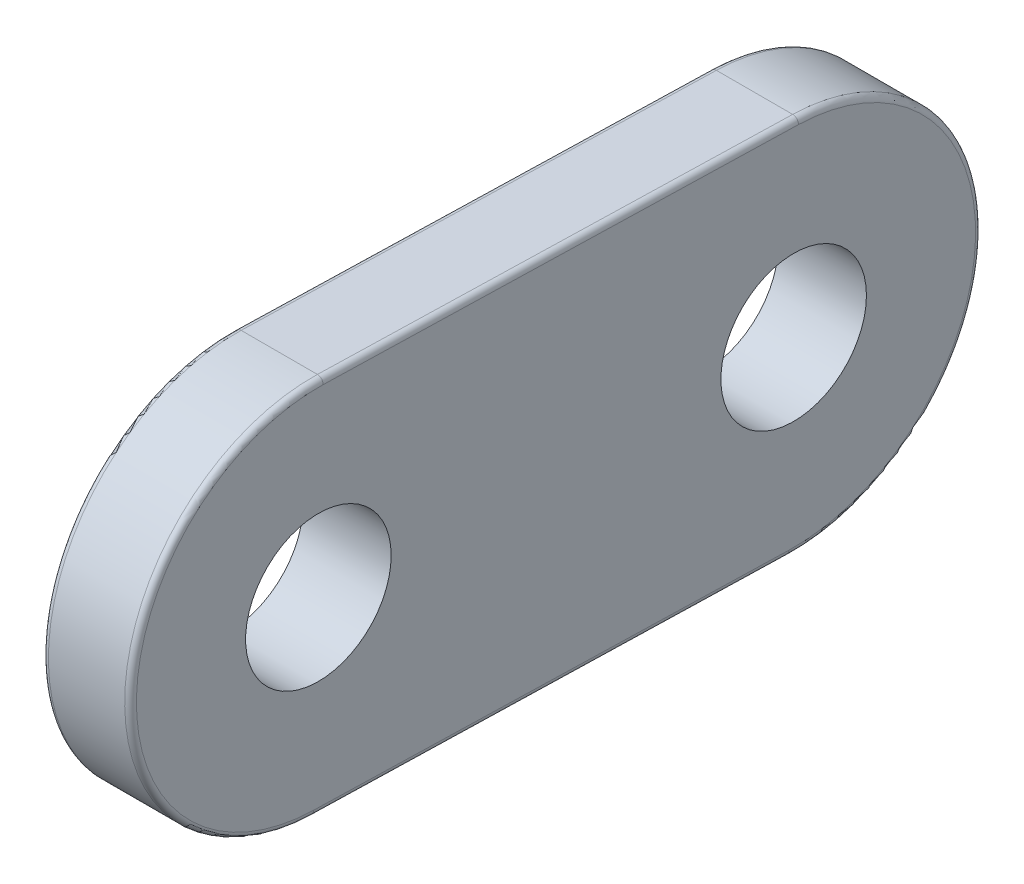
ISO-10303-21;
HEADER;
FILE_DESCRIPTION(('STEP AP214'),'2;1');
FILE_NAME('part.step','',(''),(''),'','','');
FILE_SCHEMA(('AUTOMOTIVE_DESIGN { 1 0 10303 214 1 1 1 1 }'));
ENDSEC;
DATA;
#1=APPLICATION_CONTEXT('core data for automotive mechanical design processes');
#2=APPLICATION_PROTOCOL_DEFINITION('international standard','automotive_design',2000,#1);
#3=PRODUCT_CONTEXT('',#1,'mechanical');
#4=PRODUCT('Part','Part','',(#3));
#5=PRODUCT_RELATED_PRODUCT_CATEGORY('part','',(#4));
#6=PRODUCT_DEFINITION_FORMATION('','',#4);
#7=PRODUCT_DEFINITION_CONTEXT('part definition',#1,'design');
#8=PRODUCT_DEFINITION('design','',#6,#7);
#9=PRODUCT_DEFINITION_SHAPE('','',#8);
#10=(LENGTH_UNIT() NAMED_UNIT(*) SI_UNIT(.MILLI.,.METRE.));
#11=(NAMED_UNIT(*) PLANE_ANGLE_UNIT() SI_UNIT($,.RADIAN.));
#12=(NAMED_UNIT(*) SI_UNIT($,.STERADIAN.) SOLID_ANGLE_UNIT());
#13=UNCERTAINTY_MEASURE_WITH_UNIT(LENGTH_MEASURE(1.E-05),#10,'distance_accuracy_value','');
#14=(GEOMETRIC_REPRESENTATION_CONTEXT(3) GLOBAL_UNCERTAINTY_ASSIGNED_CONTEXT((#13)) GLOBAL_UNIT_ASSIGNED_CONTEXT((#10,
#11,#12)) REPRESENTATION_CONTEXT('',''));
#15=CARTESIAN_POINT('',(0.,0.,0.));
#16=DIRECTION('',(0.,0.,1.));
#17=DIRECTION('',(1.,0.,0.));
#18=AXIS2_PLACEMENT_3D('',#15,#16,#17);
#19=CARTESIAN_POINT('',(-2.032,4.5213108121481,0.0559648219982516));
#20=DIRECTION('',(0.,-0.026176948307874,-0.999657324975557));
#21=DIRECTION('',(0.,0.999657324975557,-0.026176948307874));
#22=AXIS2_PLACEMENT_3D('',#19,#20,#21);
#23=CYLINDRICAL_SURFACE('',#22,0.127);
#24=CARTESIAN_POINT('',(-2.032,4.31934911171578,-7.65664135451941));
#25=DIRECTION('',(0.,-0.0261769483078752,-0.999657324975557));
#26=DIRECTION('',(0.,0.999657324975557,-0.0261769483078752));
#27=AXIS2_PLACEMENT_3D('',#24,#25,#26);
#28=CIRCLE('',#27,0.126999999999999);
#29=CARTESIAN_POINT('',(-1.905,4.31934911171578,-7.65664135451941));
#30=VERTEX_POINT('',#29);
#31=CARTESIAN_POINT('',(-2.032,4.19239263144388,-7.65331688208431));
#32=VERTEX_POINT('',#31);
#33=EDGE_CURVE('E69',#30,#32,#28,.T.);
#34=ORIENTED_EDGE('',*,*,#33,.F.);
#35=DIRECTION('',(0.,-0.0261769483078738,-0.999657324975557));
#36=VECTOR('',#35,1.);
#37=CARTESIAN_POINT('',(-1.905,4.58863137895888,2.62683354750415));
#38=LINE('',#37,#36);
#39=CARTESIAN_POINT('',(-1.905,4.58863137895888,2.62683354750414));
#40=VERTEX_POINT('',#39);
#41=EDGE_CURVE('E75',#40,#30,#38,.T.);
#42=ORIENTED_EDGE('',*,*,#41,.F.);
#43=CARTESIAN_POINT('',(-2.032,4.58863137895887,2.62683354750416));
#44=DIRECTION('',(0.,0.0261769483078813,0.999657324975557));
#45=DIRECTION('',(0.,-0.999657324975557,0.0261769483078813));
#46=AXIS2_PLACEMENT_3D('',#43,#44,#45);
#47=CIRCLE('',#46,0.127);
#48=CARTESIAN_POINT('',(-2.032,4.46167489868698,2.63015801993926));
#49=VERTEX_POINT('',#48);
#50=EDGE_CURVE('E136',#49,#40,#47,.T.);
#51=ORIENTED_EDGE('',*,*,#50,.F.);
#52=DIRECTION('',(0.,0.026176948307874,0.999657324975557));
#53=VECTOR('',#52,1.);
#54=CARTESIAN_POINT('',(-2.032,4.32703376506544,-2.51157943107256));
#55=LINE('',#54,#53);
#56=EDGE_CURVE('E81',#49,#32,#55,.F.);
#57=ORIENTED_EDGE('',*,*,#56,.T.);
#58=EDGE_LOOP('',(#34,#42,#51,#57));
#59=FACE_BOUND('',#58,.T.);
#60=ADVANCED_FACE('F17',(#59),#23,.T.);
#61=CARTESIAN_POINT('',(-2.032,8.25500000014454,-7.75970000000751));
#62=DIRECTION('',(1.,0.,0.));
#63=DIRECTION('',(0.,1.,0.));
#64=AXIS2_PLACEMENT_3D('',#61,#62,#63);
#65=TOROIDAL_SURFACE('',#64,3.937,0.127);
#66=CARTESIAN_POINT('',(-2.032,8.25500000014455,-7.75970000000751));
#67=DIRECTION('',(1.,0.,0.));
#68=DIRECTION('',(0.,0.,-1.));
#69=AXIS2_PLACEMENT_3D('',#66,#67,#68);
#70=CIRCLE('',#69,4.064);
#71=CARTESIAN_POINT('',(-2.032,12.3176073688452,-7.86608311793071));
#72=VERTEX_POINT('',#71);
#73=EDGE_CURVE('E90',#72,#32,#70,.F.);
#74=ORIENTED_EDGE('',*,*,#73,.F.);
#75=CARTESIAN_POINT('',(-2.032,12.1906508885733,-7.86275864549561));
#76=DIRECTION('',(0.,0.026176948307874,0.999657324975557));
#77=DIRECTION('',(0.,-0.999657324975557,0.026176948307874));
#78=AXIS2_PLACEMENT_3D('',#75,#76,#77);
#79=CIRCLE('',#78,0.127);
#80=CARTESIAN_POINT('',(-1.905,12.1906508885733,-7.86275864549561));
#81=VERTEX_POINT('',#80);
#82=EDGE_CURVE('E63',#81,#72,#79,.T.);
#83=ORIENTED_EDGE('',*,*,#82,.F.);
#84=CARTESIAN_POINT('',(-1.905,8.25500000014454,-7.75970000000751));
#85=DIRECTION('',(1.,0.,0.));
#86=DIRECTION('',(0.,1.,0.));
#87=AXIS2_PLACEMENT_3D('',#84,#85,#86);
#88=CIRCLE('',#87,3.937);
#89=EDGE_CURVE('E21',#30,#81,#88,.T.);
#90=ORIENTED_EDGE('',*,*,#89,.F.);
#91=ORIENTED_EDGE('',*,*,#33,.T.);
#92=EDGE_LOOP('',(#74,#83,#90,#91));
#93=FACE_BOUND('',#92,.T.);
#94=ADVANCED_FACE('F68',(#93),#65,.T.);
#95=CARTESIAN_POINT('',(-2.032,12.3926125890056,-0.150152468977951));
#96=DIRECTION('',(0.,0.026176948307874,0.999657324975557));
#97=DIRECTION('',(0.,-0.999657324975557,0.026176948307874));
#98=AXIS2_PLACEMENT_3D('',#95,#96,#97);
#99=CYLINDRICAL_SURFACE('',#98,0.127);
#100=ORIENTED_EDGE('',*,*,#82,.T.);
#101=DIRECTION('',(0.,-0.026176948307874,-0.999657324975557));
#102=VECTOR('',#101,1.);
#103=CARTESIAN_POINT('',(-2.032,12.4522485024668,-2.72434566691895));
#104=LINE('',#103,#102);
#105=CARTESIAN_POINT('',(-2.032,12.5868896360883,2.41739178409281));
#106=VERTEX_POINT('',#105);
#107=EDGE_CURVE('E122',#72,#106,#104,.F.);
#108=ORIENTED_EDGE('',*,*,#107,.T.);
#109=CARTESIAN_POINT('',(-2.032,12.4599331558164,2.4207162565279));
#110=DIRECTION('',(0.,0.0261769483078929,0.999657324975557));
#111=DIRECTION('',(0.,-0.999657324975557,0.0261769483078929));
#112=AXIS2_PLACEMENT_3D('',#109,#110,#111);
#113=CIRCLE('',#112,0.127);
#114=CARTESIAN_POINT('',(-1.905,12.4599331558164,2.42071625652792));
#115=VERTEX_POINT('',#114);
#116=EDGE_CURVE('E138',#115,#106,#113,.T.);
#117=ORIENTED_EDGE('',*,*,#116,.F.);
#118=DIRECTION('',(0.,0.0261769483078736,0.999657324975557));
#119=VECTOR('',#118,1.);
#120=CARTESIAN_POINT('',(-1.905,12.1906508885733,-7.86275864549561));
#121=LINE('',#120,#119);
#122=EDGE_CURVE('E74',#81,#115,#121,.T.);
#123=ORIENTED_EDGE('',*,*,#122,.F.);
#124=EDGE_LOOP('',(#100,#108,#117,#123));
#125=FACE_BOUND('',#124,.T.);
#126=ADVANCED_FACE('F180',(#125),#99,.T.);
#127=CARTESIAN_POINT('',(-2.032,8.52428226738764,2.52377490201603));
#128=DIRECTION('',(1.,0.,0.));
#129=DIRECTION('',(0.,1.,0.));
#130=AXIS2_PLACEMENT_3D('',#127,#128,#129);
#131=TOROIDAL_SURFACE('',#130,3.937,0.127);
#132=ORIENTED_EDGE('',*,*,#50,.T.);
#133=CARTESIAN_POINT('',(-1.905,8.52428226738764,2.52377490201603));
#134=DIRECTION('',(1.,0.,0.));
#135=DIRECTION('',(0.,1.,0.));
#136=AXIS2_PLACEMENT_3D('',#133,#134,#135);
#137=CIRCLE('',#136,3.937);
#138=EDGE_CURVE('E86',#115,#40,#137,.T.);
#139=ORIENTED_EDGE('',*,*,#138,.F.);
#140=ORIENTED_EDGE('',*,*,#116,.T.);
#141=CARTESIAN_POINT('',(-2.032,8.52428226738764,2.52377490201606));
#142=DIRECTION('',(1.,0.,0.));
#143=DIRECTION('',(0.,0.,-1.));
#144=AXIS2_PLACEMENT_3D('',#141,#142,#143);
#145=CIRCLE('',#144,4.064);
#146=EDGE_CURVE('E133',#49,#106,#145,.F.);
#147=ORIENTED_EDGE('',*,*,#146,.F.);
#148=EDGE_LOOP('',(#132,#139,#140,#147));
#149=FACE_BOUND('',#148,.T.);
#150=ADVANCED_FACE('F186',(#149),#131,.T.);
#151=CARTESIAN_POINT('',(-2.8575,4.32703376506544,-2.51157943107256));
#152=DIRECTION('',(0.,0.999657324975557,-0.026176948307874));
#153=DIRECTION('',(0.,0.026176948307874,0.999657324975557));
#154=AXIS2_PLACEMENT_3D('',#151,#152,#153);
#155=PLANE('',#154);
#156=ORIENTED_EDGE('',*,*,#56,.F.);
#157=DIRECTION('',(1.,0.,0.));
#158=VECTOR('',#157,1.);
#159=CARTESIAN_POINT('',(-2.8575,4.46167489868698,2.63015801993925));
#160=LINE('',#159,#158);
#161=CARTESIAN_POINT('',(-3.683,4.46167489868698,2.63015801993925));
#162=VERTEX_POINT('',#161);
#163=EDGE_CURVE('E130',#162,#49,#160,.T.);
#164=ORIENTED_EDGE('',*,*,#163,.F.);
#165=DIRECTION('',(0.,0.026176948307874,0.999657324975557));
#166=VECTOR('',#165,1.);
#167=CARTESIAN_POINT('',(-3.683,4.39435433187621,0.0592892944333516));
#168=LINE('',#167,#166);
#169=CARTESIAN_POINT('',(-3.683,4.19239263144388,-7.65331688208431));
#170=VERTEX_POINT('',#169);
#171=EDGE_CURVE('E95',#170,#162,#168,.T.);
#172=ORIENTED_EDGE('',*,*,#171,.F.);
#173=DIRECTION('',(1.,0.,0.));
#174=VECTOR('',#173,1.);
#175=CARTESIAN_POINT('',(-2.8575,4.19239263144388,-7.65331688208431));
#176=LINE('',#175,#174);
#177=EDGE_CURVE('E87',#32,#170,#176,.F.);
#178=ORIENTED_EDGE('',*,*,#177,.F.);
#179=EDGE_LOOP('',(#156,#164,#172,#178));
#180=FACE_BOUND('',#179,.T.);
#181=ADVANCED_FACE('F232',(#180),#155,.F.);
#182=CARTESIAN_POINT('',(-2.8575,8.52428226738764,2.52377490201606));
#183=DIRECTION('',(1.,0.,0.));
#184=DIRECTION('',(0.,0.,-1.));
#185=AXIS2_PLACEMENT_3D('',#182,#183,#184);
#186=CYLINDRICAL_SURFACE('',#185,4.064);
#187=CARTESIAN_POINT('',(-3.683,8.52428226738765,2.52377490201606));
#188=DIRECTION('',(-1.,0.,0.));
#189=DIRECTION('',(0.,-1.,0.));
#190=AXIS2_PLACEMENT_3D('',#187,#188,#189);
#191=CIRCLE('',#190,4.06399999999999);
#192=CARTESIAN_POINT('',(-3.683,12.5868896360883,2.41739178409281));
#193=VERTEX_POINT('',#192);
#194=EDGE_CURVE('E125',#162,#193,#191,.T.);
#195=ORIENTED_EDGE('',*,*,#194,.F.);
#196=ORIENTED_EDGE('',*,*,#163,.T.);
#197=ORIENTED_EDGE('',*,*,#146,.T.);
#198=DIRECTION('',(1.,0.,0.));
#199=VECTOR('',#198,1.);
#200=CARTESIAN_POINT('',(-2.8575,12.5868896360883,2.41739178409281));
#201=LINE('',#200,#199);
#202=EDGE_CURVE('E112',#106,#193,#201,.F.);
#203=ORIENTED_EDGE('',*,*,#202,.T.);
#204=EDGE_LOOP('',(#195,#196,#197,#203));
#205=FACE_BOUND('',#204,.T.);
#206=ADVANCED_FACE('F235',(#205),#186,.T.);
#207=CARTESIAN_POINT('',(-2.8575,12.4522485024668,-2.72434566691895));
#208=DIRECTION('',(0.,-0.999657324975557,0.026176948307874));
#209=DIRECTION('',(0.,-0.026176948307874,-0.999657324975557));
#210=AXIS2_PLACEMENT_3D('',#207,#208,#209);
#211=PLANE('',#210);
#212=ORIENTED_EDGE('',*,*,#107,.F.);
#213=DIRECTION('',(1.,0.,0.));
#214=VECTOR('',#213,1.);
#215=CARTESIAN_POINT('',(-2.8575,12.3176073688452,-7.86608311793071));
#216=LINE('',#215,#214);
#217=CARTESIAN_POINT('',(-3.683,12.3176073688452,-7.86608311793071));
#218=VERTEX_POINT('',#217);
#219=EDGE_CURVE('E109',#218,#72,#216,.T.);
#220=ORIENTED_EDGE('',*,*,#219,.F.);
#221=DIRECTION('',(0.,-0.026176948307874,-0.999657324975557));
#222=VECTOR('',#221,1.);
#223=CARTESIAN_POINT('',(-3.683,12.5195690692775,-0.153476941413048));
#224=LINE('',#223,#222);
#225=EDGE_CURVE('E115',#193,#218,#224,.T.);
#226=ORIENTED_EDGE('',*,*,#225,.F.);
#227=ORIENTED_EDGE('',*,*,#202,.F.);
#228=EDGE_LOOP('',(#212,#220,#226,#227));
#229=FACE_BOUND('',#228,.T.);
#230=ADVANCED_FACE('F200',(#229),#211,.F.);
#231=CARTESIAN_POINT('',(-2.8575,8.25500000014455,-7.75970000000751));
#232=DIRECTION('',(1.,0.,0.));
#233=DIRECTION('',(0.,0.,-1.));
#234=AXIS2_PLACEMENT_3D('',#231,#232,#233);
#235=CYLINDRICAL_SURFACE('',#234,4.064);
#236=ORIENTED_EDGE('',*,*,#73,.T.);
#237=ORIENTED_EDGE('',*,*,#177,.T.);
#238=CARTESIAN_POINT('',(-3.683,8.25500000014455,-7.75970000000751));
#239=DIRECTION('',(-1.,0.,0.));
#240=DIRECTION('',(0.,-1.,0.));
#241=AXIS2_PLACEMENT_3D('',#238,#239,#240);
#242=CIRCLE('',#241,4.064);
#243=EDGE_CURVE('E101',#218,#170,#242,.T.);
#244=ORIENTED_EDGE('',*,*,#243,.F.);
#245=ORIENTED_EDGE('',*,*,#219,.T.);
#246=EDGE_LOOP('',(#236,#237,#244,#245));
#247=FACE_BOUND('',#246,.T.);
#248=ADVANCED_FACE('F193',(#247),#235,.T.);
#249=CARTESIAN_POINT('',(-1.905,8.52428226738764,2.52377490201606));
#250=DIRECTION('',(1.,0.,0.));
#251=DIRECTION('',(0.,0.,-1.));
#252=AXIS2_PLACEMENT_3D('',#249,#250,#251);
#253=PLANE('',#252);
#254=CARTESIAN_POINT('',(-1.905,8.25500000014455,-7.75970000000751));
#255=DIRECTION('',(1.,0.,0.));
#256=DIRECTION('',(0.,0.,-1.));
#257=AXIS2_PLACEMENT_3D('',#254,#255,#256);
#258=CIRCLE('',#257,1.5748);
#259=CARTESIAN_POINT('',(-1.905,8.25500000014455,-9.33450000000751));
#260=VERTEX_POINT('',#259);
#261=EDGE_CURVE('E174',#260,#260,#258,.F.);
#262=ORIENTED_EDGE('',*,*,#261,.T.);
#263=EDGE_LOOP('',(#262));
#264=FACE_BOUND('',#263,.T.);
#265=CARTESIAN_POINT('',(-1.905,8.52428226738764,2.52377490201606));
#266=DIRECTION('',(1.,0.,0.));
#267=DIRECTION('',(0.,0.,-1.));
#268=AXIS2_PLACEMENT_3D('',#265,#266,#267);
#269=CIRCLE('',#268,1.5748);
#270=CARTESIAN_POINT('',(-1.905,8.52428226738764,0.948974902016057));
#271=VERTEX_POINT('',#270);
#272=EDGE_CURVE('E177',#271,#271,#269,.F.);
#273=ORIENTED_EDGE('',*,*,#272,.T.);
#274=EDGE_LOOP('',(#273));
#275=FACE_BOUND('',#274,.T.);
#276=ORIENTED_EDGE('',*,*,#122,.T.);
#277=ORIENTED_EDGE('',*,*,#138,.T.);
#278=ORIENTED_EDGE('',*,*,#41,.T.);
#279=ORIENTED_EDGE('',*,*,#89,.T.);
#280=EDGE_LOOP('',(#276,#277,#278,#279));
#281=FACE_BOUND('',#280,.T.);
#282=ADVANCED_FACE('F84',(#264,#275,#281),#253,.T.);
#283=CARTESIAN_POINT('',(-3.683,4.5213108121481,0.0559648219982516));
#284=DIRECTION('',(0.,0.026176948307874,0.999657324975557));
#285=DIRECTION('',(0.,-0.999657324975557,0.026176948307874));
#286=AXIS2_PLACEMENT_3D('',#283,#284,#285);
#287=CYLINDRICAL_SURFACE('',#286,0.127);
#288=CARTESIAN_POINT('',(-3.683,4.58863137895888,2.62683354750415));
#289=DIRECTION('',(0.,0.0261769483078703,0.999657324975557));
#290=DIRECTION('',(0.,-0.999657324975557,0.0261769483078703));
#291=AXIS2_PLACEMENT_3D('',#288,#289,#290);
#292=CIRCLE('',#291,0.127000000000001);
#293=CARTESIAN_POINT('',(-3.81,4.58863137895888,2.62683354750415));
#294=VERTEX_POINT('',#293);
#295=EDGE_CURVE('E98',#294,#162,#292,.T.);
#296=ORIENTED_EDGE('',*,*,#295,.F.);
#297=DIRECTION('',(0.,0.0261769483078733,0.999657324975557));
#298=VECTOR('',#297,1.);
#299=CARTESIAN_POINT('',(-3.81,4.31934911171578,-7.65664135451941));
#300=LINE('',#299,#298);
#301=CARTESIAN_POINT('',(-3.81,4.31934911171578,-7.65664135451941));
#302=VERTEX_POINT('',#301);
#303=EDGE_CURVE('E173',#302,#294,#300,.T.);
#304=ORIENTED_EDGE('',*,*,#303,.F.);
#305=CARTESIAN_POINT('',(-3.683,4.31934911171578,-7.65664135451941));
#306=DIRECTION('',(0.,-0.0261769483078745,-0.999657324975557));
#307=DIRECTION('',(0.,0.999657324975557,-0.0261769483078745));
#308=AXIS2_PLACEMENT_3D('',#305,#306,#307);
#309=CIRCLE('',#308,0.126999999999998);
#310=EDGE_CURVE('E104',#170,#302,#309,.T.);
#311=ORIENTED_EDGE('',*,*,#310,.F.);
#312=ORIENTED_EDGE('',*,*,#171,.T.);
#313=EDGE_LOOP('',(#296,#304,#311,#312));
#314=FACE_BOUND('',#313,.T.);
#315=ADVANCED_FACE('F228',(#314),#287,.T.);
#316=CARTESIAN_POINT('',(-3.683,8.52428226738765,2.52377490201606));
#317=DIRECTION('',(-1.,0.,0.));
#318=DIRECTION('',(0.,-1.,0.));
#319=AXIS2_PLACEMENT_3D('',#316,#317,#318);
#320=TOROIDAL_SURFACE('',#319,3.93699999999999,0.126999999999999);
#321=ORIENTED_EDGE('',*,*,#194,.T.);
#322=CARTESIAN_POINT('',(-3.683,12.4599331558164,2.42071625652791));
#323=DIRECTION('',(0.,-0.026176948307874,-0.999657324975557));
#324=DIRECTION('',(0.,0.999657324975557,-0.026176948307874));
#325=AXIS2_PLACEMENT_3D('',#322,#323,#324);
#326=CIRCLE('',#325,0.127);
#327=CARTESIAN_POINT('',(-3.81,12.4599331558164,2.42071625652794));
#328=VERTEX_POINT('',#327);
#329=EDGE_CURVE('E117',#328,#193,#326,.T.);
#330=ORIENTED_EDGE('',*,*,#329,.F.);
#331=CARTESIAN_POINT('',(-3.81,8.52428226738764,2.52377490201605));
#332=DIRECTION('',(-1.,0.,0.));
#333=DIRECTION('',(0.,0.,1.));
#334=AXIS2_PLACEMENT_3D('',#331,#332,#333);
#335=CIRCLE('',#334,3.937);
#336=EDGE_CURVE('E171',#294,#328,#335,.T.);
#337=ORIENTED_EDGE('',*,*,#336,.F.);
#338=ORIENTED_EDGE('',*,*,#295,.T.);
#339=EDGE_LOOP('',(#321,#330,#337,#338));
#340=FACE_BOUND('',#339,.T.);
#341=ADVANCED_FACE('F224',(#340),#320,.T.);
#342=CARTESIAN_POINT('',(-3.683,12.3926125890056,-0.150152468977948));
#343=DIRECTION('',(0.,-0.026176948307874,-0.999657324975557));
#344=DIRECTION('',(0.,0.999657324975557,-0.026176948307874));
#345=AXIS2_PLACEMENT_3D('',#342,#343,#344);
#346=CYLINDRICAL_SURFACE('',#345,0.127);
#347=ORIENTED_EDGE('',*,*,#329,.T.);
#348=ORIENTED_EDGE('',*,*,#225,.T.);
#349=CARTESIAN_POINT('',(-3.683,12.1906508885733,-7.86275864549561));
#350=DIRECTION('',(0.,-0.0261769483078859,-0.999657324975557));
#351=DIRECTION('',(0.,0.999657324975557,-0.0261769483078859));
#352=AXIS2_PLACEMENT_3D('',#349,#350,#351);
#353=CIRCLE('',#352,0.127);
#354=CARTESIAN_POINT('',(-3.81,12.1906508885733,-7.86275864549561));
#355=VERTEX_POINT('',#354);
#356=EDGE_CURVE('E36',#355,#218,#353,.T.);
#357=ORIENTED_EDGE('',*,*,#356,.F.);
#358=DIRECTION('',(0.,-0.0261769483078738,-0.999657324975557));
#359=VECTOR('',#358,1.);
#360=CARTESIAN_POINT('',(-3.81,12.4599331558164,2.42071625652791));
#361=LINE('',#360,#359);
#362=EDGE_CURVE('E170',#328,#355,#361,.T.);
#363=ORIENTED_EDGE('',*,*,#362,.F.);
#364=EDGE_LOOP('',(#347,#348,#357,#363));
#365=FACE_BOUND('',#364,.T.);
#366=ADVANCED_FACE('F205',(#365),#346,.T.);
#367=CARTESIAN_POINT('',(-3.683,8.25500000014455,-7.75970000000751));
#368=DIRECTION('',(-1.,0.,0.));
#369=DIRECTION('',(0.,-1.,0.));
#370=AXIS2_PLACEMENT_3D('',#367,#368,#369);
#371=TOROIDAL_SURFACE('',#370,3.937,0.127);
#372=ORIENTED_EDGE('',*,*,#310,.T.);
#373=CARTESIAN_POINT('',(-3.81,8.25500000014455,-7.75970000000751));
#374=DIRECTION('',(-1.,0.,0.));
#375=DIRECTION('',(0.,-1.,0.));
#376=AXIS2_PLACEMENT_3D('',#373,#374,#375);
#377=CIRCLE('',#376,3.937);
#378=EDGE_CURVE('E167',#355,#302,#377,.T.);
#379=ORIENTED_EDGE('',*,*,#378,.F.);
#380=ORIENTED_EDGE('',*,*,#356,.T.);
#381=ORIENTED_EDGE('',*,*,#243,.T.);
#382=EDGE_LOOP('',(#372,#379,#380,#381));
#383=FACE_BOUND('',#382,.T.);
#384=ADVANCED_FACE('F19',(#383),#371,.T.);
#385=CARTESIAN_POINT('',(-2.8575,8.52428226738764,2.52377490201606));
#386=DIRECTION('',(1.,0.,0.));
#387=DIRECTION('',(0.,0.,-1.));
#388=AXIS2_PLACEMENT_3D('',#385,#386,#387);
#389=CYLINDRICAL_SURFACE('',#388,1.5748);
#390=ORIENTED_EDGE('',*,*,#272,.F.);
#391=EDGE_LOOP('',(#390));
#392=FACE_BOUND('',#391,.T.);
#393=CARTESIAN_POINT('',(-3.81,8.52428226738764,2.52377490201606));
#394=DIRECTION('',(1.,0.,0.));
#395=DIRECTION('',(0.,0.,-1.));
#396=AXIS2_PLACEMENT_3D('',#393,#394,#395);
#397=CIRCLE('',#396,1.5748);
#398=CARTESIAN_POINT('',(-3.81,8.52428226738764,0.948974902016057));
#399=VERTEX_POINT('',#398);
#400=EDGE_CURVE('E27',#399,#399,#397,.T.);
#401=ORIENTED_EDGE('',*,*,#400,.F.);
#402=EDGE_LOOP('',(#401));
#403=FACE_BOUND('',#402,.T.);
#404=ADVANCED_FACE('F253',(#392,#403),#389,.F.);
#405=CARTESIAN_POINT('',(-2.8575,8.25500000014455,-7.75970000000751));
#406=DIRECTION('',(1.,0.,0.));
#407=DIRECTION('',(0.,0.,-1.));
#408=AXIS2_PLACEMENT_3D('',#405,#406,#407);
#409=CYLINDRICAL_SURFACE('',#408,1.5748);
#410=ORIENTED_EDGE('',*,*,#261,.F.);
#411=EDGE_LOOP('',(#410));
#412=FACE_BOUND('',#411,.T.);
#413=CARTESIAN_POINT('',(-3.81,8.25500000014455,-7.75970000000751));
#414=DIRECTION('',(1.,0.,0.));
#415=DIRECTION('',(0.,0.,-1.));
#416=AXIS2_PLACEMENT_3D('',#413,#414,#415);
#417=CIRCLE('',#416,1.5748);
#418=CARTESIAN_POINT('',(-3.81,8.25500000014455,-9.33450000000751));
#419=VERTEX_POINT('',#418);
#420=EDGE_CURVE('E11',#419,#419,#417,.T.);
#421=ORIENTED_EDGE('',*,*,#420,.F.);
#422=EDGE_LOOP('',(#421));
#423=FACE_BOUND('',#422,.T.);
#424=ADVANCED_FACE('F247',(#412,#423),#409,.F.);
#425=CARTESIAN_POINT('',(-3.81,8.52428226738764,2.52377490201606));
#426=DIRECTION('',(-1.,0.,0.));
#427=DIRECTION('',(0.,0.,1.));
#428=AXIS2_PLACEMENT_3D('',#425,#426,#427);
#429=PLANE('',#428);
#430=ORIENTED_EDGE('',*,*,#420,.T.);
#431=EDGE_LOOP('',(#430));
#432=FACE_BOUND('',#431,.T.);
#433=ORIENTED_EDGE('',*,*,#400,.T.);
#434=EDGE_LOOP('',(#433));
#435=FACE_BOUND('',#434,.T.);
#436=ORIENTED_EDGE('',*,*,#362,.T.);
#437=ORIENTED_EDGE('',*,*,#378,.T.);
#438=ORIENTED_EDGE('',*,*,#303,.T.);
#439=ORIENTED_EDGE('',*,*,#336,.T.);
#440=EDGE_LOOP('',(#436,#437,#438,#439));
#441=FACE_BOUND('',#440,.T.);
#442=ADVANCED_FACE('F245',(#432,#435,#441),#429,.T.);
#443=CLOSED_SHELL('',(#60,#94,#126,#150,#181,#206,#230,#248,#282,#315,#341,#366,#384,#404,#424,#442));
#444=MANIFOLD_SOLID_BREP('B1',#443);
#445=ADVANCED_BREP_SHAPE_REPRESENTATION('',(#18,#444),#14);
#446=SHAPE_DEFINITION_REPRESENTATION(#9,#445);
ENDSEC;
END-ISO-10303-21;
